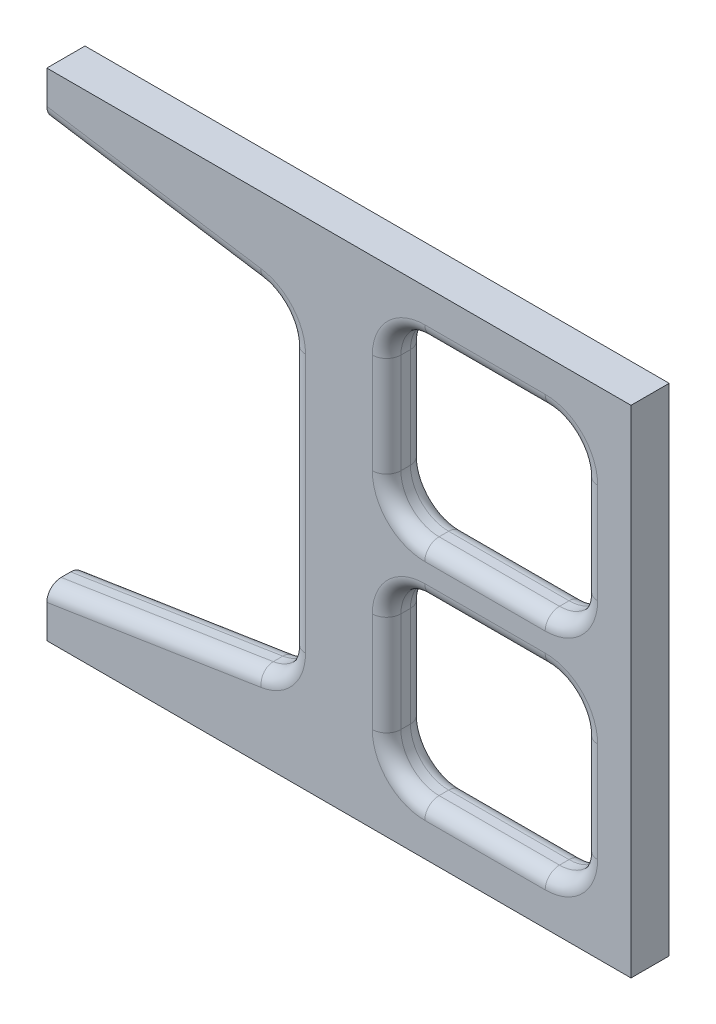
from build123d import *

# Parameters (mm, degrees)
EXTRUDE_1_DEPTH = 16
FILLET_2_R      = 6
FILLET_3_R      = 6
FILLET_4_R      = 6


with BuildPart() as part:
    # Sketch 1 → Extrude 1 (new body)
    with BuildSketch(Plane.XY):
        with BuildLine():
            Line((-20, -54.303802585), (-20, 54.303802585))
            ThreePointArc((-20, 54.303802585), (-23.845107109, 64.708540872), (-33.532322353, 70.112362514))
            Line((-33.532322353, 70.112362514), (-122.5, 84))
            Line((-122.5, 84), (-122.5, 104))
            Line((-122.5, 104), (122.5, 104))
            Line((122.5, 104), (122.5, -104))
            Line((122.5, -104), (-122.5, -104))
            Line((-122.5, -104), (-122.5, -84))
            Line((-122.5, -84), (-33.532322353, -70.112362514))
            ThreePointArc((-33.532322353, -70.112362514), (-23.845107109, -64.708540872), (-20, -54.303802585))
        make_face()
        with BuildLine():
            Line((102.5, 68), (102.5, 26))
            ThreePointArc((102.5, 26), (97.813708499, 14.686291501), (86.5, 10))
            Line((86.5, 10), (36, 10))
            ThreePointArc((36, 10), (24.686291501, 14.686291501), (20, 26))
            Line((20, 26), (20, 68))
            ThreePointArc((20, 68), (24.686291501, 79.313708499), (36, 84))
            Line((36, 84), (86.5, 84))
            ThreePointArc((86.5, 84), (97.813708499, 79.313708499), (102.5, 68))
        make_face(mode=Mode.SUBTRACT)
        with BuildLine():
            Line((36, -84), (86.5, -84))
            ThreePointArc((86.5, -84), (97.813708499, -79.313708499), (102.5, -68))
            Line((102.5, -68), (102.5, -26))
            ThreePointArc((102.5, -26), (97.813708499, -14.686291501), (86.5, -10))
            Line((86.5, -10), (36, -10))
            ThreePointArc((36, -10), (24.686291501, -14.686291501), (20, -26))
            Line((20, -26), (20, -68))
            ThreePointArc((20, -68), (24.686291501, -79.313708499), (36, -84))
        make_face(mode=Mode.SUBTRACT)
    extrude(amount=EXTRUDE_1_DEPTH)

    # Fillet 2
    fillet_2_edges = [part.edges().sort_by_distance(p)[0] for p in [
        (24.686291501, 79.313708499, 0),
        (20, 47, 0),
        (24.686291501, 14.686291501, 0),
        (61.25, 10, 0),
        (97.813708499, 14.686291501, 0),
        (102.5, 47, 0),
        (97.813708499, 79.313708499, 0),
        (61.25, 84, 0),
        (24.686291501, 79.313708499, 16),
        (20, 47, 16),
        (24.686291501, 14.686291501, 16),
        (61.25, 10, 16),
        (97.813708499, 14.686291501, 16),
        (102.5, 47, 16),
        (97.813708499, 79.313708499, 16),
        (61.25, 84, 16),
    ]]
    fillet(fillet_2_edges, radius=FILLET_2_R)

    # Fillet 3
    fillet_3_edges = [part.edges().sort_by_distance(p)[0] for p in [
        (-78.016161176, -77.056181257, 0),
        (-23.845107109, -64.708540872, 0),
        (-20, 0, 0),
        (-23.845107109, 64.708540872, 0),
        (-78.016161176, 77.056181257, 0),
        (-78.016161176, 77.056181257, 16),
        (-23.845107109, 64.708540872, 16),
        (-20, 0, 16),
        (-23.845107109, -64.708540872, 16),
        (-78.016161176, -77.056181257, 16),
    ]]
    fillet(fillet_3_edges, radius=FILLET_3_R)

    # Fillet 4
    fillet_4_edges = [part.edges().sort_by_distance(p)[0] for p in [
        (97.813708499, -79.313708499, 0),
        (102.5, -47, 0),
        (97.813708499, -14.686291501, 0),
        (61.25, -10, 0),
        (24.686291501, -14.686291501, 0),
        (20, -47, 0),
        (24.686291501, -79.313708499, 0),
        (61.25, -84, 0),
        (97.813708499, -79.313708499, 16),
        (102.5, -47, 16),
        (97.813708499, -14.686291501, 16),
        (61.25, -10, 16),
        (24.686291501, -14.686291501, 16),
        (20, -47, 16),
        (24.686291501, -79.313708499, 16),
        (61.25, -84, 16),
    ]]
    fillet(fillet_4_edges, radius=FILLET_4_R)


solid = part.part
